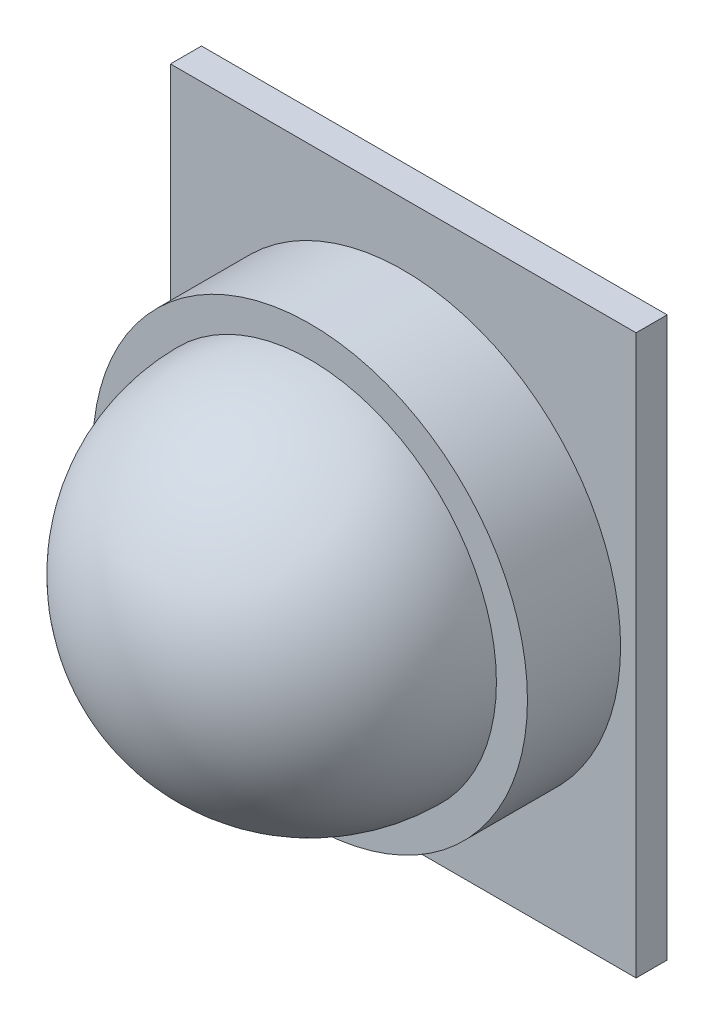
ISO-10303-21;
HEADER;
FILE_DESCRIPTION(('STEP AP214'),'2;1');
FILE_NAME('part.step','',(''),(''),'','','');
FILE_SCHEMA(('AUTOMOTIVE_DESIGN { 1 0 10303 214 1 1 1 1 }'));
ENDSEC;
DATA;
#1=APPLICATION_CONTEXT('core data for automotive mechanical design processes');
#2=APPLICATION_PROTOCOL_DEFINITION('international standard','automotive_design',2000,#1);
#3=PRODUCT_CONTEXT('',#1,'mechanical');
#4=PRODUCT('Part','Part','',(#3));
#5=PRODUCT_RELATED_PRODUCT_CATEGORY('part','',(#4));
#6=PRODUCT_DEFINITION_FORMATION('','',#4);
#7=PRODUCT_DEFINITION_CONTEXT('part definition',#1,'design');
#8=PRODUCT_DEFINITION('design','',#6,#7);
#9=PRODUCT_DEFINITION_SHAPE('','',#8);
#10=(LENGTH_UNIT() NAMED_UNIT(*) SI_UNIT(.MILLI.,.METRE.));
#11=(NAMED_UNIT(*) PLANE_ANGLE_UNIT() SI_UNIT($,.RADIAN.));
#12=(NAMED_UNIT(*) SI_UNIT($,.STERADIAN.) SOLID_ANGLE_UNIT());
#13=UNCERTAINTY_MEASURE_WITH_UNIT(LENGTH_MEASURE(1.E-05),#10,'distance_accuracy_value','');
#14=(GEOMETRIC_REPRESENTATION_CONTEXT(3) GLOBAL_UNCERTAINTY_ASSIGNED_CONTEXT((#13)) GLOBAL_UNIT_ASSIGNED_CONTEXT((#10,
#11,#12)) REPRESENTATION_CONTEXT('',''));
#15=CARTESIAN_POINT('',(0.,0.,0.));
#16=DIRECTION('',(0.,0.,1.));
#17=DIRECTION('',(1.,0.,0.));
#18=AXIS2_PLACEMENT_3D('',#15,#16,#17);
#19=CARTESIAN_POINT('',(0.,0.,2.));
#20=DIRECTION('',(0.,0.,1.));
#21=DIRECTION('',(1.,0.,0.));
#22=AXIS2_PLACEMENT_3D('',#19,#20,#21);
#23=PLANE('',#22);
#24=CARTESIAN_POINT('',(0.,0.,2.));
#25=DIRECTION('',(0.,0.,1.));
#26=DIRECTION('',(1.,0.,0.));
#27=AXIS2_PLACEMENT_3D('',#24,#25,#26);
#28=CIRCLE('',#27,3.5);
#29=CARTESIAN_POINT('',(3.5,0.,2.));
#30=VERTEX_POINT('',#29);
#31=EDGE_CURVE('E90',#30,#30,#28,.T.);
#32=ORIENTED_EDGE('',*,*,#31,.T.);
#33=EDGE_LOOP('',(#32));
#34=FACE_BOUND('',#33,.T.);
#35=CARTESIAN_POINT('',(0.,0.,2.));
#36=DIRECTION('',(0.,0.,-1.));
#37=DIRECTION('',(1.,0.,0.));
#38=AXIS2_PLACEMENT_3D('',#35,#36,#37);
#39=CIRCLE('',#38,3.);
#40=CARTESIAN_POINT('',(3.,0.,2.00000000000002));
#41=VERTEX_POINT('',#40);
#42=EDGE_CURVE('E119',#41,#41,#39,.T.);
#43=ORIENTED_EDGE('',*,*,#42,.T.);
#44=EDGE_LOOP('',(#43));
#45=FACE_BOUND('',#44,.T.);
#46=ADVANCED_FACE('F32',(#34,#45),#23,.T.);
#47=CARTESIAN_POINT('',(-3.75,-4.5,0.5));
#48=DIRECTION('',(0.,0.,1.));
#49=DIRECTION('',(1.,0.,0.));
#50=AXIS2_PLACEMENT_3D('',#47,#48,#49);
#51=PLANE('',#50);
#52=DIRECTION('',(0.,-1.,0.));
#53=VECTOR('',#52,1.);
#54=CARTESIAN_POINT('',(-3.75,4.5,0.5));
#55=LINE('',#54,#53);
#56=CARTESIAN_POINT('',(-3.75,4.5,0.5));
#57=VERTEX_POINT('',#56);
#58=CARTESIAN_POINT('',(-3.75,-4.5,0.5));
#59=VERTEX_POINT('',#58);
#60=EDGE_CURVE('E100',#57,#59,#55,.T.);
#61=ORIENTED_EDGE('',*,*,#60,.T.);
#62=DIRECTION('',(1.,0.,0.));
#63=VECTOR('',#62,1.);
#64=CARTESIAN_POINT('',(-3.75,-4.5,0.5));
#65=LINE('',#64,#63);
#66=CARTESIAN_POINT('',(3.75,-4.5,0.5));
#67=VERTEX_POINT('',#66);
#68=EDGE_CURVE('E85',#59,#67,#65,.T.);
#69=ORIENTED_EDGE('',*,*,#68,.T.);
#70=DIRECTION('',(0.,1.,0.));
#71=VECTOR('',#70,1.);
#72=CARTESIAN_POINT('',(3.75,4.5,0.5));
#73=LINE('',#72,#71);
#74=CARTESIAN_POINT('',(3.75,4.5,0.5));
#75=VERTEX_POINT('',#74);
#76=EDGE_CURVE('E52',#67,#75,#73,.T.);
#77=ORIENTED_EDGE('',*,*,#76,.T.);
#78=DIRECTION('',(-1.,0.,0.));
#79=VECTOR('',#78,1.);
#80=CARTESIAN_POINT('',(-3.75,4.5,0.5));
#81=LINE('',#80,#79);
#82=EDGE_CURVE('E47',#75,#57,#81,.T.);
#83=ORIENTED_EDGE('',*,*,#82,.T.);
#84=EDGE_LOOP('',(#61,#69,#77,#83));
#85=FACE_BOUND('',#84,.T.);
#86=CARTESIAN_POINT('',(0.,0.,0.5));
#87=DIRECTION('',(0.,0.,1.));
#88=DIRECTION('',(1.,0.,0.));
#89=AXIS2_PLACEMENT_3D('',#86,#87,#88);
#90=CIRCLE('',#89,3.5);
#91=CARTESIAN_POINT('',(3.5,0.,0.5));
#92=VERTEX_POINT('',#91);
#93=EDGE_CURVE('E93',#92,#92,#90,.T.);
#94=ORIENTED_EDGE('',*,*,#93,.F.);
#95=EDGE_LOOP('',(#94));
#96=FACE_BOUND('',#95,.T.);
#97=ADVANCED_FACE('F112',(#85,#96),#51,.T.);
#98=CARTESIAN_POINT('',(-3.75,4.5,0.5));
#99=DIRECTION('',(1.,0.,0.));
#100=DIRECTION('',(0.,1.,0.));
#101=AXIS2_PLACEMENT_3D('',#98,#99,#100);
#102=PLANE('',#101);
#103=DIRECTION('',(0.,-1.,0.));
#104=VECTOR('',#103,1.);
#105=CARTESIAN_POINT('',(-3.75,4.5,0.));
#106=LINE('',#105,#104);
#107=CARTESIAN_POINT('',(-3.75,4.5,0.));
#108=VERTEX_POINT('',#107);
#109=CARTESIAN_POINT('',(-3.75,-4.5,0.));
#110=VERTEX_POINT('',#109);
#111=EDGE_CURVE('E77',#108,#110,#106,.T.);
#112=ORIENTED_EDGE('',*,*,#111,.T.);
#113=DIRECTION('',(0.,0.,-1.));
#114=VECTOR('',#113,1.);
#115=CARTESIAN_POINT('',(-3.75,-4.5,0.5));
#116=LINE('',#115,#114);
#117=EDGE_CURVE('E11',#59,#110,#116,.T.);
#118=ORIENTED_EDGE('',*,*,#117,.F.);
#119=ORIENTED_EDGE('',*,*,#60,.F.);
#120=DIRECTION('',(0.,0.,-1.));
#121=VECTOR('',#120,1.);
#122=CARTESIAN_POINT('',(-3.75,4.5,0.5));
#123=LINE('',#122,#121);
#124=EDGE_CURVE('E89',#57,#108,#123,.T.);
#125=ORIENTED_EDGE('',*,*,#124,.T.);
#126=EDGE_LOOP('',(#112,#118,#119,#125));
#127=FACE_BOUND('',#126,.T.);
#128=ADVANCED_FACE('F34',(#127),#102,.F.);
#129=CARTESIAN_POINT('',(-3.75,-4.5,0.5));
#130=DIRECTION('',(0.,1.,0.));
#131=DIRECTION('',(0.,0.,1.));
#132=AXIS2_PLACEMENT_3D('',#129,#130,#131);
#133=PLANE('',#132);
#134=DIRECTION('',(1.,0.,0.));
#135=VECTOR('',#134,1.);
#136=CARTESIAN_POINT('',(-3.75,-4.5,0.));
#137=LINE('',#136,#135);
#138=CARTESIAN_POINT('',(3.75,-4.5,0.));
#139=VERTEX_POINT('',#138);
#140=EDGE_CURVE('E73',#110,#139,#137,.T.);
#141=ORIENTED_EDGE('',*,*,#140,.T.);
#142=DIRECTION('',(0.,0.,-1.));
#143=VECTOR('',#142,1.);
#144=CARTESIAN_POINT('',(3.75,-4.5,0.5));
#145=LINE('',#144,#143);
#146=EDGE_CURVE('E40',#67,#139,#145,.T.);
#147=ORIENTED_EDGE('',*,*,#146,.F.);
#148=ORIENTED_EDGE('',*,*,#68,.F.);
#149=ORIENTED_EDGE('',*,*,#117,.T.);
#150=EDGE_LOOP('',(#141,#147,#148,#149));
#151=FACE_BOUND('',#150,.T.);
#152=ADVANCED_FACE('F84',(#151),#133,.F.);
#153=CARTESIAN_POINT('',(3.75,4.5,0.5));
#154=DIRECTION('',(-1.,0.,0.));
#155=DIRECTION('',(0.,-1.,0.));
#156=AXIS2_PLACEMENT_3D('',#153,#154,#155);
#157=PLANE('',#156);
#158=DIRECTION('',(0.,1.,0.));
#159=VECTOR('',#158,1.);
#160=CARTESIAN_POINT('',(3.75,4.5,0.));
#161=LINE('',#160,#159);
#162=CARTESIAN_POINT('',(3.75,4.5,0.));
#163=VERTEX_POINT('',#162);
#164=EDGE_CURVE('E78',#139,#163,#161,.T.);
#165=ORIENTED_EDGE('',*,*,#164,.T.);
#166=DIRECTION('',(0.,0.,-1.));
#167=VECTOR('',#166,1.);
#168=CARTESIAN_POINT('',(3.75,4.5,0.5));
#169=LINE('',#168,#167);
#170=EDGE_CURVE('E106',#75,#163,#169,.T.);
#171=ORIENTED_EDGE('',*,*,#170,.F.);
#172=ORIENTED_EDGE('',*,*,#76,.F.);
#173=ORIENTED_EDGE('',*,*,#146,.T.);
#174=EDGE_LOOP('',(#165,#171,#172,#173));
#175=FACE_BOUND('',#174,.T.);
#176=ADVANCED_FACE('F109',(#175),#157,.F.);
#177=CARTESIAN_POINT('',(-3.75,4.5,0.5));
#178=DIRECTION('',(0.,-1.,0.));
#179=DIRECTION('',(0.,0.,-1.));
#180=AXIS2_PLACEMENT_3D('',#177,#178,#179);
#181=PLANE('',#180);
#182=DIRECTION('',(-1.,0.,0.));
#183=VECTOR('',#182,1.);
#184=CARTESIAN_POINT('',(-3.75,4.5,0.));
#185=LINE('',#184,#183);
#186=EDGE_CURVE('E98',#163,#108,#185,.T.);
#187=ORIENTED_EDGE('',*,*,#186,.T.);
#188=ORIENTED_EDGE('',*,*,#124,.F.);
#189=ORIENTED_EDGE('',*,*,#82,.F.);
#190=ORIENTED_EDGE('',*,*,#170,.T.);
#191=EDGE_LOOP('',(#187,#188,#189,#190));
#192=FACE_BOUND('',#191,.T.);
#193=ADVANCED_FACE('F111',(#192),#181,.F.);
#194=CARTESIAN_POINT('',(-3.75,-4.5,0.));
#195=DIRECTION('',(0.,0.,1.));
#196=DIRECTION('',(1.,0.,0.));
#197=AXIS2_PLACEMENT_3D('',#194,#195,#196);
#198=PLANE('',#197);
#199=ORIENTED_EDGE('',*,*,#111,.F.);
#200=ORIENTED_EDGE('',*,*,#186,.F.);
#201=ORIENTED_EDGE('',*,*,#164,.F.);
#202=ORIENTED_EDGE('',*,*,#140,.F.);
#203=EDGE_LOOP('',(#199,#200,#201,#202));
#204=FACE_BOUND('',#203,.T.);
#205=ADVANCED_FACE('F74',(#204),#198,.F.);
#206=CARTESIAN_POINT('',(0.,0.,2.));
#207=DIRECTION('',(0.,0.,-1.));
#208=DIRECTION('',(-1.,0.,0.));
#209=AXIS2_PLACEMENT_3D('',#206,#207,#208);
#210=CYLINDRICAL_SURFACE('',#209,3.5);
#211=ORIENTED_EDGE('',*,*,#31,.F.);
#212=EDGE_LOOP('',(#211));
#213=FACE_BOUND('',#212,.T.);
#214=ORIENTED_EDGE('',*,*,#93,.T.);
#215=EDGE_LOOP('',(#214));
#216=FACE_BOUND('',#215,.T.);
#217=ADVANCED_FACE('F127',(#213,#216),#210,.T.);
#218=CARTESIAN_POINT('',(0.,0.,2.));
#219=DIRECTION('',(0.,1.,0.));
#220=DIRECTION('',(-1.,0.,0.));
#221=AXIS2_PLACEMENT_3D('',#218,#219,#220);
#222=SPHERICAL_SURFACE('',#221,3.);
#223=CARTESIAN_POINT('',(0.,0.,2.));
#224=DIRECTION('',(0.,0.,-1.));
#225=DIRECTION('',(1.,0.,0.));
#226=AXIS2_PLACEMENT_3D('',#223,#224,#225);
#227=SPHERICAL_SURFACE('',#226,3.);
#228=ORIENTED_EDGE('',*,*,#42,.F.);
#229=EDGE_LOOP('',(#228));
#230=FACE_BOUND('',#229,.T.);
#231=ADVANCED_FACE('F125',(#230),#227,.T.);
#232=CLOSED_SHELL('',(#46,#97,#128,#152,#176,#193,#205,#217,#231));
#233=MANIFOLD_SOLID_BREP('B2',#232);
#234=ADVANCED_BREP_SHAPE_REPRESENTATION('',(#18,#233),#14);
#235=SHAPE_DEFINITION_REPRESENTATION(#9,#234);
ENDSEC;
END-ISO-10303-21;
